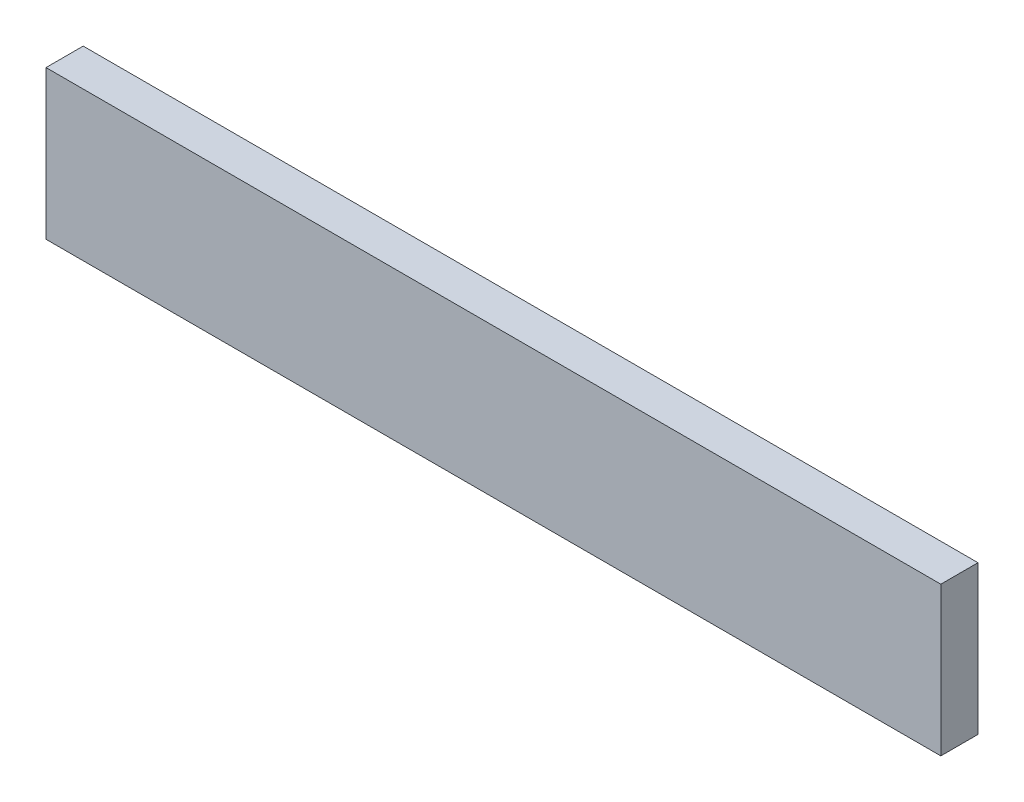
ISO-10303-21;
HEADER;
FILE_DESCRIPTION(('STEP AP214'),'2;1');
FILE_NAME('part.step','',(''),(''),'','','');
FILE_SCHEMA(('AUTOMOTIVE_DESIGN { 1 0 10303 214 1 1 1 1 }'));
ENDSEC;
DATA;
#1=APPLICATION_CONTEXT('core data for automotive mechanical design processes');
#2=APPLICATION_PROTOCOL_DEFINITION('international standard','automotive_design',2000,#1);
#3=PRODUCT_CONTEXT('',#1,'mechanical');
#4=PRODUCT('Part','Part','',(#3));
#5=PRODUCT_RELATED_PRODUCT_CATEGORY('part','',(#4));
#6=PRODUCT_DEFINITION_FORMATION('','',#4);
#7=PRODUCT_DEFINITION_CONTEXT('part definition',#1,'design');
#8=PRODUCT_DEFINITION('design','',#6,#7);
#9=PRODUCT_DEFINITION_SHAPE('','',#8);
#10=(LENGTH_UNIT() NAMED_UNIT(*) SI_UNIT(.MILLI.,.METRE.));
#11=(NAMED_UNIT(*) PLANE_ANGLE_UNIT() SI_UNIT($,.RADIAN.));
#12=(NAMED_UNIT(*) SI_UNIT($,.STERADIAN.) SOLID_ANGLE_UNIT());
#13=UNCERTAINTY_MEASURE_WITH_UNIT(LENGTH_MEASURE(1.E-05),#10,'distance_accuracy_value','');
#14=(GEOMETRIC_REPRESENTATION_CONTEXT(3) GLOBAL_UNCERTAINTY_ASSIGNED_CONTEXT((#13)) GLOBAL_UNIT_ASSIGNED_CONTEXT((#10,
#11,#12)) REPRESENTATION_CONTEXT('',''));
#15=CARTESIAN_POINT('',(0.,0.,0.));
#16=DIRECTION('',(0.,0.,1.));
#17=DIRECTION('',(1.,0.,0.));
#18=AXIS2_PLACEMENT_3D('',#15,#16,#17);
#19=CARTESIAN_POINT('',(180.5,30.,15.));
#20=DIRECTION('',(-1.,0.,0.));
#21=DIRECTION('',(0.,0.,1.));
#22=AXIS2_PLACEMENT_3D('',#19,#20,#21);
#23=PLANE('',#22);
#24=DIRECTION('',(0.,1.,0.));
#25=VECTOR('',#24,1.);
#26=CARTESIAN_POINT('',(180.5,30.,0.));
#27=LINE('',#26,#25);
#28=CARTESIAN_POINT('',(180.5,-30.,0.));
#29=VERTEX_POINT('',#28);
#30=CARTESIAN_POINT('',(180.5,30.,0.));
#31=VERTEX_POINT('',#30);
#32=EDGE_CURVE('E95',#29,#31,#27,.T.);
#33=ORIENTED_EDGE('',*,*,#32,.T.);
#34=DIRECTION('',(0.,0.,-1.));
#35=VECTOR('',#34,1.);
#36=CARTESIAN_POINT('',(180.5,30.,15.));
#37=LINE('',#36,#35);
#38=CARTESIAN_POINT('',(180.5,30.,15.));
#39=VERTEX_POINT('',#38);
#40=EDGE_CURVE('E11',#39,#31,#37,.T.);
#41=ORIENTED_EDGE('',*,*,#40,.F.);
#42=DIRECTION('',(0.,1.,0.));
#43=VECTOR('',#42,1.);
#44=CARTESIAN_POINT('',(180.5,30.,15.));
#45=LINE('',#44,#43);
#46=CARTESIAN_POINT('',(180.5,-30.,15.));
#47=VERTEX_POINT('',#46);
#48=EDGE_CURVE('E83',#47,#39,#45,.T.);
#49=ORIENTED_EDGE('',*,*,#48,.F.);
#50=DIRECTION('',(0.,0.,-1.));
#51=VECTOR('',#50,1.);
#52=CARTESIAN_POINT('',(180.5,-30.,15.));
#53=LINE('',#52,#51);
#54=EDGE_CURVE('E91',#47,#29,#53,.T.);
#55=ORIENTED_EDGE('',*,*,#54,.T.);
#56=EDGE_LOOP('',(#33,#41,#49,#55));
#57=FACE_BOUND('',#56,.T.);
#58=ADVANCED_FACE('F32',(#57),#23,.F.);
#59=CARTESIAN_POINT('',(-180.5,30.,15.));
#60=DIRECTION('',(0.,-1.,0.));
#61=DIRECTION('',(0.,0.,-1.));
#62=AXIS2_PLACEMENT_3D('',#59,#60,#61);
#63=PLANE('',#62);
#64=DIRECTION('',(-1.,0.,0.));
#65=VECTOR('',#64,1.);
#66=CARTESIAN_POINT('',(-180.5,30.,0.));
#67=LINE('',#66,#65);
#68=CARTESIAN_POINT('',(-180.5,30.,0.));
#69=VERTEX_POINT('',#68);
#70=EDGE_CURVE('E87',#31,#69,#67,.T.);
#71=ORIENTED_EDGE('',*,*,#70,.T.);
#72=DIRECTION('',(0.,0.,-1.));
#73=VECTOR('',#72,1.);
#74=CARTESIAN_POINT('',(-180.5,30.,15.));
#75=LINE('',#74,#73);
#76=CARTESIAN_POINT('',(-180.5,30.,15.));
#77=VERTEX_POINT('',#76);
#78=EDGE_CURVE('E40',#77,#69,#75,.T.);
#79=ORIENTED_EDGE('',*,*,#78,.F.);
#80=DIRECTION('',(-1.,0.,0.));
#81=VECTOR('',#80,1.);
#82=CARTESIAN_POINT('',(-180.5,30.,15.));
#83=LINE('',#82,#81);
#84=EDGE_CURVE('E78',#39,#77,#83,.T.);
#85=ORIENTED_EDGE('',*,*,#84,.F.);
#86=ORIENTED_EDGE('',*,*,#40,.T.);
#87=EDGE_LOOP('',(#71,#79,#85,#86));
#88=FACE_BOUND('',#87,.T.);
#89=ADVANCED_FACE('F86',(#88),#63,.F.);
#90=CARTESIAN_POINT('',(-180.5,30.,15.));
#91=DIRECTION('',(1.,0.,0.));
#92=DIRECTION('',(0.,0.,-1.));
#93=AXIS2_PLACEMENT_3D('',#90,#91,#92);
#94=PLANE('',#93);
#95=DIRECTION('',(0.,-1.,0.));
#96=VECTOR('',#95,1.);
#97=CARTESIAN_POINT('',(-180.5,30.,0.));
#98=LINE('',#97,#96);
#99=CARTESIAN_POINT('',(-180.5,-30.,0.));
#100=VERTEX_POINT('',#99);
#101=EDGE_CURVE('E65',#69,#100,#98,.T.);
#102=ORIENTED_EDGE('',*,*,#101,.T.);
#103=DIRECTION('',(0.,0.,-1.));
#104=VECTOR('',#103,1.);
#105=CARTESIAN_POINT('',(-180.5,-30.,15.));
#106=LINE('',#105,#104);
#107=CARTESIAN_POINT('',(-180.5,-30.,15.));
#108=VERTEX_POINT('',#107);
#109=EDGE_CURVE('E88',#108,#100,#106,.T.);
#110=ORIENTED_EDGE('',*,*,#109,.F.);
#111=DIRECTION('',(0.,-1.,0.));
#112=VECTOR('',#111,1.);
#113=CARTESIAN_POINT('',(-180.5,30.,15.));
#114=LINE('',#113,#112);
#115=EDGE_CURVE('E81',#77,#108,#114,.T.);
#116=ORIENTED_EDGE('',*,*,#115,.F.);
#117=ORIENTED_EDGE('',*,*,#78,.T.);
#118=EDGE_LOOP('',(#102,#110,#116,#117));
#119=FACE_BOUND('',#118,.T.);
#120=ADVANCED_FACE('F89',(#119),#94,.F.);
#121=CARTESIAN_POINT('',(-180.5,-30.,15.));
#122=DIRECTION('',(0.,1.,0.));
#123=DIRECTION('',(0.,0.,1.));
#124=AXIS2_PLACEMENT_3D('',#121,#122,#123);
#125=PLANE('',#124);
#126=DIRECTION('',(1.,0.,0.));
#127=VECTOR('',#126,1.);
#128=CARTESIAN_POINT('',(-180.5,-30.,0.));
#129=LINE('',#128,#127);
#130=EDGE_CURVE('E71',#100,#29,#129,.T.);
#131=ORIENTED_EDGE('',*,*,#130,.T.);
#132=ORIENTED_EDGE('',*,*,#54,.F.);
#133=DIRECTION('',(1.,0.,0.));
#134=VECTOR('',#133,1.);
#135=CARTESIAN_POINT('',(-180.5,-30.,15.));
#136=LINE('',#135,#134);
#137=EDGE_CURVE('E48',#108,#47,#136,.T.);
#138=ORIENTED_EDGE('',*,*,#137,.F.);
#139=ORIENTED_EDGE('',*,*,#109,.T.);
#140=EDGE_LOOP('',(#131,#132,#138,#139));
#141=FACE_BOUND('',#140,.T.);
#142=ADVANCED_FACE('F102',(#141),#125,.F.);
#143=CARTESIAN_POINT('',(0.,0.,15.));
#144=DIRECTION('',(0.,0.,1.));
#145=DIRECTION('',(1.,0.,0.));
#146=AXIS2_PLACEMENT_3D('',#143,#144,#145);
#147=PLANE('',#146);
#148=ORIENTED_EDGE('',*,*,#48,.T.);
#149=ORIENTED_EDGE('',*,*,#84,.T.);
#150=ORIENTED_EDGE('',*,*,#115,.T.);
#151=ORIENTED_EDGE('',*,*,#137,.T.);
#152=EDGE_LOOP('',(#148,#149,#150,#151));
#153=FACE_BOUND('',#152,.T.);
#154=ADVANCED_FACE('F79',(#153),#147,.T.);
#155=CARTESIAN_POINT('',(0.,0.,0.));
#156=DIRECTION('',(0.,0.,1.));
#157=DIRECTION('',(1.,0.,0.));
#158=AXIS2_PLACEMENT_3D('',#155,#156,#157);
#159=PLANE('',#158);
#160=ORIENTED_EDGE('',*,*,#32,.F.);
#161=ORIENTED_EDGE('',*,*,#130,.F.);
#162=ORIENTED_EDGE('',*,*,#101,.F.);
#163=ORIENTED_EDGE('',*,*,#70,.F.);
#164=EDGE_LOOP('',(#160,#161,#162,#163));
#165=FACE_BOUND('',#164,.T.);
#166=ADVANCED_FACE('F105',(#165),#159,.F.);
#167=CLOSED_SHELL('',(#58,#89,#120,#142,#154,#166));
#168=MANIFOLD_SOLID_BREP('B2',#167);
#169=ADVANCED_BREP_SHAPE_REPRESENTATION('',(#18,#168),#14);
#170=SHAPE_DEFINITION_REPRESENTATION(#9,#169);
ENDSEC;
END-ISO-10303-21;
